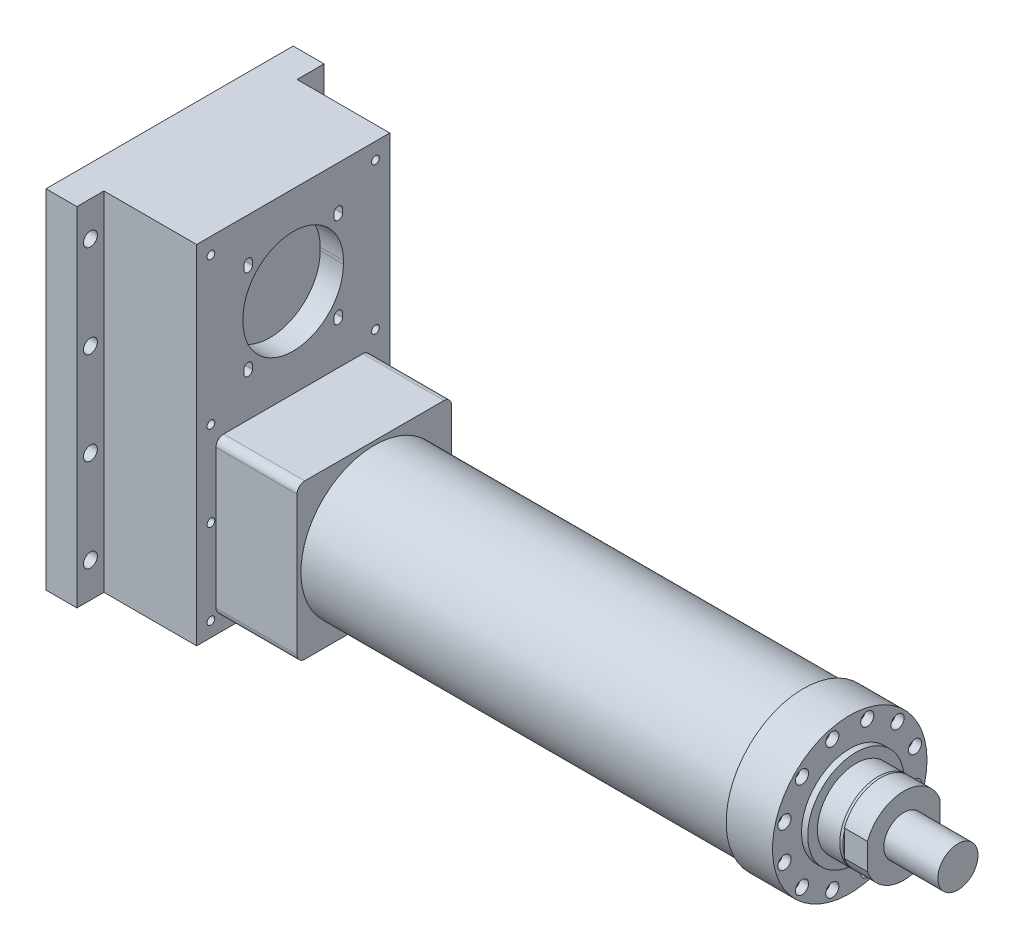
from build123d import *

# Parameters (mm, degrees)
SKETCH_1_R           = 95
SKETCH_1_R_2         = 80
EXTRUDE_1_DEPTH      = 555.5
SKETCH_2_R           = 100
EXTRUDE_2_DEPTH      = 60
SKETCH_3_R           = 62.5
EXTRUDE_3_DEPTH      = 8
SKETCH_4_R           = 8.5
CUT_EXTRUDE_3_DEPTH  = 11
SKETCH_6_R           = 50
EXTRUDE_4_DEPTH      = 32
CHAMFER_1_SIZE       = 3
CHAMFER_1_SIZE2      = 1.091910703
EXTRUDE_5_DEPTH      = 30
SKETCH_8_R           = 26
CUT_EXTRUDE_4_DEPTH  = 82
EXTRUDE_6_DEPTH      = 105
SKETCH_14_W          = 250
SKETCH_14_H          = 450
EXTRUDE_8_DEPTH      = 120
SKETCH_15_R          = 5
CUT_EXTRUDE_10_DEPTH = 128
CUT_EXTRUDE_11_DEPTH = 30
SKETCH_16_R          = 26
EXTRUDE_9_DEPTH      = 70
SKETCH_4_6_R         = 5.5
CUT_EXTRUDE_13_DEPTH = 92
SKETCH_18_W          = 320
SKETCH_18_H          = 450
SKETCH_18_R          = 9
EXTRUDE_10_DEPTH     = 40


with BuildPart() as part:
    # Sketch 1 → Extrude 1 (new body)
    with BuildSketch(Plane(origin=(0, 0, 0), x_dir=(0, 0, -1), z_dir=(1, 0, 0))):
        Circle(SKETCH_1_R)
        Circle(SKETCH_1_R_2, mode=Mode.SUBTRACT)
    extrude(amount=EXTRUDE_1_DEPTH)

    # Sketch 2 → Extrude 2 (add)
    with BuildSketch(Plane(origin=(555.5, 0, 0), x_dir=(0, 0, -1), z_dir=(1, 0, 0))):
        Circle(SKETCH_2_R)
    extrude(amount=EXTRUDE_2_DEPTH)

    # Sketch 3 → Extrude 3 (add)
    with BuildSketch(Plane(origin=(615.5, 0, 0), x_dir=(0, 0, -1), z_dir=(1, 0, 0))):
        Circle(SKETCH_3_R)
    extrude(amount=EXTRUDE_3_DEPTH)

    # Sketch 4 → Cut-Extrude 3 (cut)
    with BuildSketch(Plane(origin=(615.5, 0, 0), x_dir=(0, 0, -1), z_dir=(1, 0, 0))):
        with Locations((-22.646666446, 84.5185098)):
            Circle(SKETCH_4_R)
        with Locations((22.646666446, 84.5185098)):
            Circle(SKETCH_4_R)
        with Locations((61.871843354, 61.871843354)):
            Circle(SKETCH_4_R)
        with Locations((84.5185098, 22.646666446)):
            Circle(SKETCH_4_R)
        with Locations((84.5185098, -22.646666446)):
            Circle(SKETCH_4_R)
        with Locations((61.871843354, -61.871843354)):
            Circle(SKETCH_4_R)
        with Locations((22.646666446, -84.5185098)):
            Circle(SKETCH_4_R)
        with Locations((-22.646666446, -84.5185098)):
            Circle(SKETCH_4_R)
        with Locations((-61.871843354, -61.871843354)):
            Circle(SKETCH_4_R)
        with Locations((-84.5185098, -22.646666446)):
            Circle(SKETCH_4_R)
        with Locations((-84.5185098, 22.646666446)):
            Circle(SKETCH_4_R)
        with Locations((-61.871843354, 61.871843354)):
            Circle(SKETCH_4_R)
    extrude(amount=-CUT_EXTRUDE_3_DEPTH, mode=Mode.SUBTRACT)

    # Sketch 6 → Extrude 4 (add)
    with BuildSketch(Plane(origin=(623.5, 0, 0), x_dir=(0, 0, -1), z_dir=(1, 0, 0))):
        Circle(SKETCH_6_R)
    extrude(amount=EXTRUDE_4_DEPTH)

    # Chamfer 1
    chamfer_1_edges = [part.edges().sort_by_distance(p)[0] for p in [
        (655.5, 0, 50),
    ]]
    chamfer_1_side = [part.faces().sort_by_distance(p)[0] for p in [
        (639.5, 0, 50),
    ]]
    chamfer(chamfer_1_edges, length=CHAMFER_1_SIZE, length2=CHAMFER_1_SIZE2, reference=chamfer_1_side[0])

    # Sketch 7 → Extrude 5 (add)
    with BuildSketch(Plane(origin=(655.5, 0, 0), x_dir=(0, 0, -1), z_dir=(1, 0, 0))):
        with BuildLine():
            Line((-47, 17.058722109), (-47, -17.058722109))
            ThreePointArc((-47, -17.058722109), (0, -50), (47, -17.058722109))
            Line((47, -17.058722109), (47, 17.058722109))
            ThreePointArc((47, 17.058722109), (0, 50), (-47, 17.058722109))
        make_face()
    extrude(amount=EXTRUDE_5_DEPTH)

    # Sketch 8 → Cut-Extrude 4 (cut)
    with BuildSketch(Plane(origin=(685.5, 0, 0), x_dir=(0, 0, -1), z_dir=(1, 0, 0))):
        Circle(SKETCH_8_R)
    extrude(amount=-CUT_EXTRUDE_4_DEPTH, mode=Mode.SUBTRACT)

    # Sketch 9 → Extrude 6 (add)
    with BuildSketch(Plane.ZY):
        with BuildLine():
            Line((-90, 100), (90, 100))
            ThreePointArc((90, 100), (97.071067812, 97.071067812), (100, 90))
            Line((100, 90), (100, -90))
            ThreePointArc((100, -90), (97.071067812, -97.071067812), (90, -100))
            Line((90, -100), (-90, -100))
            ThreePointArc((-90, -100), (-97.071067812, -97.071067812), (-100, -90))
            Line((-100, -90), (-100, 90))
            ThreePointArc((-100, 90), (-97.071067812, 97.071067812), (-90, 100))
        make_face()
    extrude(amount=EXTRUDE_6_DEPTH)

    # Sketch 14 → Extrude 8 (add)
    with BuildSketch(Plane.ZY.offset(105)):
        with Locations((0, 105)):
            Rectangle(SKETCH_14_W, SKETCH_14_H)
    extrude(amount=EXTRUDE_8_DEPTH)

    # Sketch 15 → Cut-Extrude 10 (cut)
    with BuildSketch(Plane(origin=(-105, 0, 0), x_dir=(0, 0, -1), z_dir=(1, 0, 0))):
        with Locations((-106.5, 309)):
            Circle(SKETCH_15_R)
        with Locations((106.5, 309)):
            Circle(SKETCH_15_R)
        with Locations((106.5, 119)):
            Circle(SKETCH_15_R)
        with Locations((-106.5, 119)):
            Circle(SKETCH_15_R)
        with Locations((-106.5, 9)):
            Circle(SKETCH_15_R)
        with Locations((106.5, 9)):
            Circle(SKETCH_15_R)
        with Locations((-106.5, -101)):
            Circle(SKETCH_15_R)
        with Locations((106.5, -101)):
            Circle(SKETCH_15_R)
    extrude(amount=-CUT_EXTRUDE_10_DEPTH, mode=Mode.SUBTRACT)

    # Sketch 15_3 → Cut-Extrude 11 (cut)
    with BuildSketch(Plane(origin=(-105, 0, 0), x_dir=(0, 0, -1), z_dir=(1, 0, 0))):
        with BuildLine():
            Line((-65, 217), (-65, 213))
            ThreePointArc((-65, 213), (0, 148), (65, 213))
            Line((65, 213), (65, 217))
            ThreePointArc((65, 217), (0, 282), (-65, 217))
        make_face()
        with BuildLine():
            Line((-63.836309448, 270.836309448), (-63.836309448, 275.836309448))
            ThreePointArc((-63.836309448, 275.836309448), (-58.336309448, 281.336309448), (-52.836309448, 275.836309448))
            Line((-52.836309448, 275.836309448), (-52.836309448, 270.836309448))
            ThreePointArc((-52.836309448, 270.836309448), (-58.336309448, 265.336309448), (-63.836309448, 270.836309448))
        make_face()
        with BuildLine():
            Line((63.836309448, 270.836309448), (63.836309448, 275.836309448))
            ThreePointArc((63.836309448, 275.836309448), (58.336309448, 281.336309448), (52.836309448, 275.836309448))
            Line((52.836309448, 275.836309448), (52.836309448, 270.836309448))
            ThreePointArc((52.836309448, 270.836309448), (58.336309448, 265.336309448), (63.836309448, 270.836309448))
        make_face()
        with BuildLine():
            Line((63.836309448, 159.163690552), (63.836309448, 154.163690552))
            ThreePointArc((63.836309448, 154.163690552), (58.336309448, 148.663690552), (52.836309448, 154.163690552))
            Line((52.836309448, 154.163690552), (52.836309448, 159.163690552))
            ThreePointArc((52.836309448, 159.163690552), (58.336309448, 164.663690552), (63.836309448, 159.163690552))
        make_face()
        with BuildLine():
            Line((-63.836309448, 159.163690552), (-63.836309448, 154.163690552))
            ThreePointArc((-63.836309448, 154.163690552), (-58.336309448, 148.663690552), (-52.836309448, 154.163690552))
            Line((-52.836309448, 154.163690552), (-52.836309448, 159.163690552))
            ThreePointArc((-52.836309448, 159.163690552), (-58.336309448, 164.663690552), (-63.836309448, 159.163690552))
        make_face()
    extrude(amount=-CUT_EXTRUDE_11_DEPTH, mode=Mode.SUBTRACT)

    # Sketch 4_6 → Cut-Extrude 13 (cut)
    with BuildSketch(Plane(origin=(615.5, 0, 0), x_dir=(0, 0, -1), z_dir=(1, 0, 0))):
        with Locations((-22.646666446, 84.5185098)):
            Circle(SKETCH_4_6_R)
        with Locations((22.646666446, 84.5185098)):
            Circle(SKETCH_4_6_R)
        with Locations((61.871843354, 61.871843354)):
            Circle(SKETCH_4_6_R)
        with Locations((84.5185098, 22.646666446)):
            Circle(SKETCH_4_6_R)
        with Locations((84.5185098, -22.646666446)):
            Circle(SKETCH_4_6_R)
        with Locations((61.871843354, -61.871843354)):
            Circle(SKETCH_4_6_R)
        with Locations((22.646666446, -84.5185098)):
            Circle(SKETCH_4_6_R)
        with Locations((-22.646666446, -84.5185098)):
            Circle(SKETCH_4_6_R)
        with Locations((-61.871843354, -61.871843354)):
            Circle(SKETCH_4_6_R)
        with Locations((-84.5185098, -22.646666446)):
            Circle(SKETCH_4_6_R)
        with Locations((-84.5185098, 22.646666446)):
            Circle(SKETCH_4_6_R)
        with Locations((-61.871843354, 61.871843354)):
            Circle(SKETCH_4_6_R)
    extrude(amount=-CUT_EXTRUDE_13_DEPTH, mode=Mode.SUBTRACT)

    # Sketch 18 → Extrude 10 (add)
    with BuildSketch(Plane.ZY.offset(225)):
        with Locations((0, 105)):
            Rectangle(SKETCH_18_W, SKETCH_18_H)
        with Locations((-142.5, 285)):
            Circle(SKETCH_18_R, mode=Mode.SUBTRACT)
        with Locations((-142.5, 165)):
            Circle(SKETCH_18_R, mode=Mode.SUBTRACT)
        with Locations((-142.5, 45)):
            Circle(SKETCH_18_R, mode=Mode.SUBTRACT)
        with Locations((-142.5, -75)):
            Circle(SKETCH_18_R, mode=Mode.SUBTRACT)
        with Locations(Location((142.5, -75, 0), (0, 0, 180))):
            Circle(SKETCH_18_R, mode=Mode.SUBTRACT)
        with Locations(Location((142.5, 45, 0), (0, 0, 180))):
            Circle(SKETCH_18_R, mode=Mode.SUBTRACT)
        with Locations(Location((142.5, 165, 0), (0, 0, 180))):
            Circle(SKETCH_18_R, mode=Mode.SUBTRACT)
        with Locations(Location((142.5, 285, 0), (0, 0, 180))):
            Circle(SKETCH_18_R, mode=Mode.SUBTRACT)
    extrude(amount=EXTRUDE_10_DEPTH)


with BuildPart() as body_2:
    # Sketch 16 → Extrude 9 (new body)
    with BuildSketch(Plane(origin=(685.5, 0, 0), x_dir=(0, 0, -1), z_dir=(1, 0, 0))):
        Circle(SKETCH_16_R)
    extrude(amount=EXTRUDE_9_DEPTH)


solid = Compound([part.part, body_2.part])
